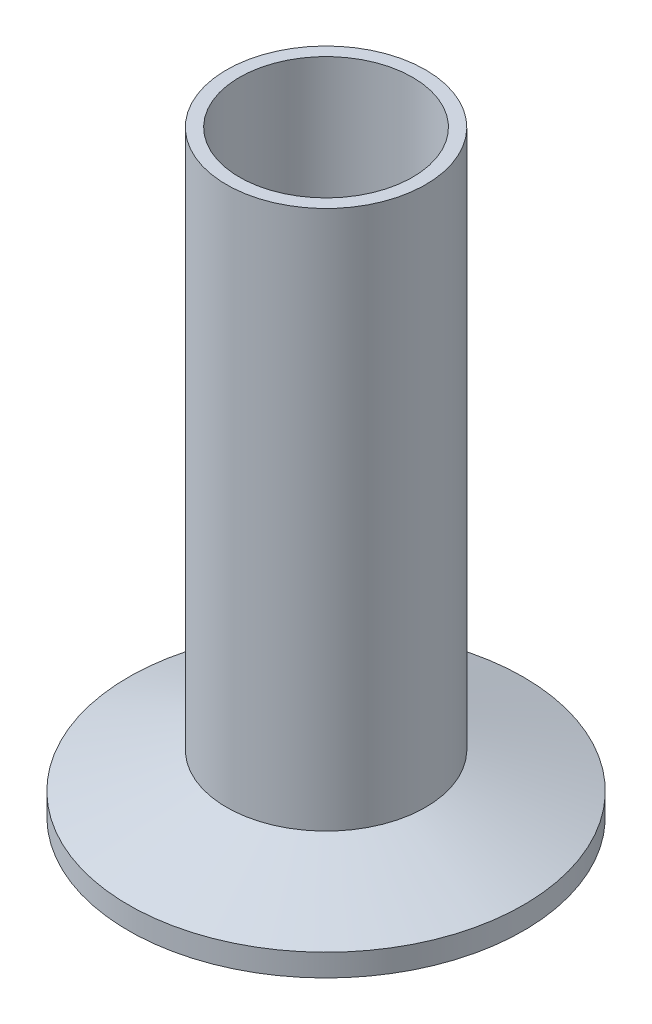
ISO-10303-21;
HEADER;
FILE_DESCRIPTION(('STEP AP214'),'2;1');
FILE_NAME('part.step','',(''),(''),'','','');
FILE_SCHEMA(('AUTOMOTIVE_DESIGN { 1 0 10303 214 1 1 1 1 }'));
ENDSEC;
DATA;
#1=APPLICATION_CONTEXT('core data for automotive mechanical design processes');
#2=APPLICATION_PROTOCOL_DEFINITION('international standard','automotive_design',2000,#1);
#3=PRODUCT_CONTEXT('',#1,'mechanical');
#4=PRODUCT('Part','Part','',(#3));
#5=PRODUCT_RELATED_PRODUCT_CATEGORY('part','',(#4));
#6=PRODUCT_DEFINITION_FORMATION('','',#4);
#7=PRODUCT_DEFINITION_CONTEXT('part definition',#1,'design');
#8=PRODUCT_DEFINITION('design','',#6,#7);
#9=PRODUCT_DEFINITION_SHAPE('','',#8);
#10=(LENGTH_UNIT() NAMED_UNIT(*) SI_UNIT(.MILLI.,.METRE.));
#11=(NAMED_UNIT(*) PLANE_ANGLE_UNIT() SI_UNIT($,.RADIAN.));
#12=(NAMED_UNIT(*) SI_UNIT($,.STERADIAN.) SOLID_ANGLE_UNIT());
#13=UNCERTAINTY_MEASURE_WITH_UNIT(LENGTH_MEASURE(1.E-05),#10,'distance_accuracy_value','');
#14=(GEOMETRIC_REPRESENTATION_CONTEXT(3) GLOBAL_UNCERTAINTY_ASSIGNED_CONTEXT((#13)) GLOBAL_UNIT_ASSIGNED_CONTEXT((#10,
#11,#12)) REPRESENTATION_CONTEXT('',''));
#15=CARTESIAN_POINT('',(0.,0.,0.));
#16=DIRECTION('',(0.,0.,1.));
#17=DIRECTION('',(1.,0.,0.));
#18=AXIS2_PLACEMENT_3D('',#15,#16,#17);
#19=CARTESIAN_POINT('',(0.,0.7874,0.));
#20=DIRECTION('',(0.,-1.,0.));
#21=DIRECTION('',(0.,0.,-1.));
#22=AXIS2_PLACEMENT_3D('',#19,#20,#21);
#23=TOROIDAL_SURFACE('',#22,23.6366084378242,0.787399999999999);
#24=CARTESIAN_POINT('',(0.,0.,0.));
#25=DIRECTION('',(0.,-1.,0.));
#26=DIRECTION('',(0.,0.,-1.));
#27=AXIS2_PLACEMENT_3D('',#24,#25,#26);
#28=CIRCLE('',#27,23.6366084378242);
#29=CARTESIAN_POINT('',(0.,0.,-23.6366084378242));
#30=VERTEX_POINT('',#29);
#31=EDGE_CURVE('E67',#30,#30,#28,.T.);
#32=ORIENTED_EDGE('',*,*,#31,.T.);
#33=EDGE_LOOP('',(#32));
#34=FACE_BOUND('',#33,.T.);
#35=CARTESIAN_POINT('',(0.,0.474458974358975,0.));
#36=DIRECTION('',(0.,-1.,0.));
#37=DIRECTION('',(0.,0.,-1.));
#38=AXIS2_PLACEMENT_3D('',#35,#36,#37);
#39=CIRCLE('',#38,22.9140666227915);
#40=CARTESIAN_POINT('',(0.,0.474458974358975,-22.9140666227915));
#41=VERTEX_POINT('',#40);
#42=EDGE_CURVE('E10',#41,#41,#39,.T.);
#43=ORIENTED_EDGE('',*,*,#42,.F.);
#44=EDGE_LOOP('',(#43));
#45=FACE_BOUND('',#44,.T.);
#46=ADVANCED_FACE('F33',(#34,#45),#23,.T.);
#47=CARTESIAN_POINT('',(0.,0.,0.));
#48=DIRECTION('',(0.,-1.,0.));
#49=DIRECTION('',(0.,0.,-1.));
#50=AXIS2_PLACEMENT_3D('',#47,#48,#49);
#51=TOROIDAL_SURFACE('',#50,21.8186,1.1938);
#52=CARTESIAN_POINT('',(0.,0.474458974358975,0.));
#53=DIRECTION('',(0.,-1.,0.));
#54=DIRECTION('',(0.,0.,-1.));
#55=AXIS2_PLACEMENT_3D('',#52,#53,#54);
#56=CIRCLE('',#55,20.7231333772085);
#57=CARTESIAN_POINT('',(0.,0.474458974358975,-20.7231333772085));
#58=VERTEX_POINT('',#57);
#59=EDGE_CURVE('E39',#58,#58,#56,.T.);
#60=ORIENTED_EDGE('',*,*,#59,.F.);
#61=EDGE_LOOP('',(#60));
#62=FACE_BOUND('',#61,.T.);
#63=ORIENTED_EDGE('',*,*,#42,.T.);
#64=EDGE_LOOP('',(#63));
#65=FACE_BOUND('',#64,.T.);
#66=ADVANCED_FACE('F115',(#62,#65),#51,.F.);
#67=CARTESIAN_POINT('',(0.,0.787400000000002,0.));
#68=DIRECTION('',(0.,-1.,0.));
#69=DIRECTION('',(0.,0.,-1.));
#70=AXIS2_PLACEMENT_3D('',#67,#68,#69);
#71=TOROIDAL_SURFACE('',#70,20.0005915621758,0.787399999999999);
#72=ORIENTED_EDGE('',*,*,#59,.T.);
#73=EDGE_LOOP('',(#72));
#74=FACE_BOUND('',#73,.T.);
#75=CARTESIAN_POINT('',(0.,0.,0.));
#76=DIRECTION('',(0.,-1.,0.));
#77=DIRECTION('',(0.,0.,-1.));
#78=AXIS2_PLACEMENT_3D('',#75,#76,#77);
#79=CIRCLE('',#78,20.0005915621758);
#80=CARTESIAN_POINT('',(0.,0.,-20.0005915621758));
#81=VERTEX_POINT('',#80);
#82=EDGE_CURVE('E43',#81,#81,#79,.T.);
#83=ORIENTED_EDGE('',*,*,#82,.F.);
#84=EDGE_LOOP('',(#83));
#85=FACE_BOUND('',#84,.T.);
#86=ADVANCED_FACE('F111',(#74,#85),#71,.T.);
#87=CARTESIAN_POINT('',(0.,0.,0.));
#88=DIRECTION('',(0.,1.,0.));
#89=DIRECTION('',(0.,0.,1.));
#90=AXIS2_PLACEMENT_3D('',#87,#88,#89);
#91=PLANE('',#90);
#92=CARTESIAN_POINT('',(0.,0.,0.));
#93=DIRECTION('',(0.,-1.,0.));
#94=DIRECTION('',(0.,0.,-1.));
#95=AXIS2_PLACEMENT_3D('',#92,#93,#94);
#96=CIRCLE('',#95,11.049);
#97=CARTESIAN_POINT('',(0.,0.,-11.049));
#98=VERTEX_POINT('',#97);
#99=EDGE_CURVE('E47',#98,#98,#96,.T.);
#100=ORIENTED_EDGE('',*,*,#99,.F.);
#101=EDGE_LOOP('',(#100));
#102=FACE_BOUND('',#101,.T.);
#103=ORIENTED_EDGE('',*,*,#82,.T.);
#104=EDGE_LOOP('',(#103));
#105=FACE_BOUND('',#104,.T.);
#106=ADVANCED_FACE('F105',(#102,#105),#91,.F.);
#107=CARTESIAN_POINT('',(0.,0.,0.));
#108=DIRECTION('',(0.,-1.,0.));
#109=DIRECTION('',(0.,0.,-1.));
#110=AXIS2_PLACEMENT_3D('',#107,#108,#109);
#111=CYLINDRICAL_SURFACE('',#110,11.049);
#112=ORIENTED_EDGE('',*,*,#99,.T.);
#113=EDGE_LOOP('',(#112));
#114=FACE_BOUND('',#113,.T.);
#115=CARTESIAN_POINT('',(0.,76.2,0.));
#116=DIRECTION('',(0.,-1.,0.));
#117=DIRECTION('',(0.,0.,-1.));
#118=AXIS2_PLACEMENT_3D('',#115,#116,#117);
#119=CIRCLE('',#118,11.049);
#120=CARTESIAN_POINT('',(0.,76.2,-11.049));
#121=VERTEX_POINT('',#120);
#122=EDGE_CURVE('E52',#121,#121,#119,.T.);
#123=ORIENTED_EDGE('',*,*,#122,.F.);
#124=EDGE_LOOP('',(#123));
#125=FACE_BOUND('',#124,.T.);
#126=ADVANCED_FACE('F100',(#114,#125),#111,.F.);
#127=CARTESIAN_POINT('',(0.,76.2,0.));
#128=DIRECTION('',(0.,-1.,0.));
#129=DIRECTION('',(0.,0.,-1.));
#130=AXIS2_PLACEMENT_3D('',#127,#128,#129);
#131=PLANE('',#130);
#132=CARTESIAN_POINT('',(0.,76.2,0.));
#133=DIRECTION('',(0.,-1.,0.));
#134=DIRECTION('',(0.,0.,-1.));
#135=AXIS2_PLACEMENT_3D('',#132,#133,#134);
#136=CIRCLE('',#135,12.7);
#137=CARTESIAN_POINT('',(0.,76.2,-12.7));
#138=VERTEX_POINT('',#137);
#139=EDGE_CURVE('E55',#138,#138,#136,.T.);
#140=ORIENTED_EDGE('',*,*,#139,.F.);
#141=EDGE_LOOP('',(#140));
#142=FACE_BOUND('',#141,.T.);
#143=ORIENTED_EDGE('',*,*,#122,.T.);
#144=EDGE_LOOP('',(#143));
#145=FACE_BOUND('',#144,.T.);
#146=ADVANCED_FACE('F94',(#142,#145),#131,.F.);
#147=CARTESIAN_POINT('',(0.,0.,0.));
#148=DIRECTION('',(0.,-1.,0.));
#149=DIRECTION('',(0.,0.,-1.));
#150=AXIS2_PLACEMENT_3D('',#147,#148,#149);
#151=CYLINDRICAL_SURFACE('',#150,12.7);
#152=CARTESIAN_POINT('',(0.,7.39326322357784,0.));
#153=DIRECTION('',(0.,-1.,0.));
#154=DIRECTION('',(0.,0.,-1.));
#155=AXIS2_PLACEMENT_3D('',#152,#153,#154);
#156=CIRCLE('',#155,12.7);
#157=CARTESIAN_POINT('',(0.,7.39326322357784,-12.7));
#158=VERTEX_POINT('',#157);
#159=EDGE_CURVE('E58',#158,#158,#156,.T.);
#160=ORIENTED_EDGE('',*,*,#159,.F.);
#161=EDGE_LOOP('',(#160));
#162=FACE_BOUND('',#161,.T.);
#163=ORIENTED_EDGE('',*,*,#139,.T.);
#164=EDGE_LOOP('',(#163));
#165=FACE_BOUND('',#164,.T.);
#166=ADVANCED_FACE('F88',(#162,#165),#151,.T.);
#167=CARTESIAN_POINT('',(0.,7.39326322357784,0.));
#168=DIRECTION('',(0.,-1.,0.));
#169=DIRECTION('',(0.,0.,-1.));
#170=AXIS2_PLACEMENT_3D('',#167,#168,#169);
#171=CONICAL_SURFACE('',#170,12.7,1.22173047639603);
#172=CARTESIAN_POINT('',(0.,2.8448,0.));
#173=DIRECTION('',(0.,-1.,0.));
#174=DIRECTION('',(0.,0.,-1.));
#175=AXIS2_PLACEMENT_3D('',#172,#173,#174);
#176=CIRCLE('',#175,25.1968);
#177=CARTESIAN_POINT('',(0.,2.8448,-25.1968));
#178=VERTEX_POINT('',#177);
#179=EDGE_CURVE('E61',#178,#178,#176,.T.);
#180=ORIENTED_EDGE('',*,*,#179,.F.);
#181=EDGE_LOOP('',(#180));
#182=FACE_BOUND('',#181,.T.);
#183=ORIENTED_EDGE('',*,*,#159,.T.);
#184=EDGE_LOOP('',(#183));
#185=FACE_BOUND('',#184,.T.);
#186=ADVANCED_FACE('F82',(#182,#185),#171,.T.);
#187=CARTESIAN_POINT('',(0.,0.,0.));
#188=DIRECTION('',(0.,-1.,0.));
#189=DIRECTION('',(0.,0.,-1.));
#190=AXIS2_PLACEMENT_3D('',#187,#188,#189);
#191=CYLINDRICAL_SURFACE('',#190,25.1968);
#192=CARTESIAN_POINT('',(0.,0.,0.));
#193=DIRECTION('',(0.,-1.,0.));
#194=DIRECTION('',(0.,0.,-1.));
#195=AXIS2_PLACEMENT_3D('',#192,#193,#194);
#196=CIRCLE('',#195,25.1968);
#197=CARTESIAN_POINT('',(0.,0.,-25.1968));
#198=VERTEX_POINT('',#197);
#199=EDGE_CURVE('E64',#198,#198,#196,.T.);
#200=ORIENTED_EDGE('',*,*,#199,.F.);
#201=EDGE_LOOP('',(#200));
#202=FACE_BOUND('',#201,.T.);
#203=ORIENTED_EDGE('',*,*,#179,.T.);
#204=EDGE_LOOP('',(#203));
#205=FACE_BOUND('',#204,.T.);
#206=ADVANCED_FACE('F76',(#202,#205),#191,.T.);
#207=CARTESIAN_POINT('',(0.,0.,0.));
#208=DIRECTION('',(0.,1.,0.));
#209=DIRECTION('',(0.,0.,1.));
#210=AXIS2_PLACEMENT_3D('',#207,#208,#209);
#211=PLANE('',#210);
#212=ORIENTED_EDGE('',*,*,#31,.F.);
#213=EDGE_LOOP('',(#212));
#214=FACE_BOUND('',#213,.T.);
#215=ORIENTED_EDGE('',*,*,#199,.T.);
#216=EDGE_LOOP('',(#215));
#217=FACE_BOUND('',#216,.T.);
#218=ADVANCED_FACE('F73',(#214,#217),#211,.F.);
#219=CLOSED_SHELL('',(#46,#66,#86,#106,#126,#146,#166,#186,#206,#218));
#220=MANIFOLD_SOLID_BREP('B2',#219);
#221=ADVANCED_BREP_SHAPE_REPRESENTATION('',(#18,#220),#14);
#222=SHAPE_DEFINITION_REPRESENTATION(#9,#221);
ENDSEC;
END-ISO-10303-21;
